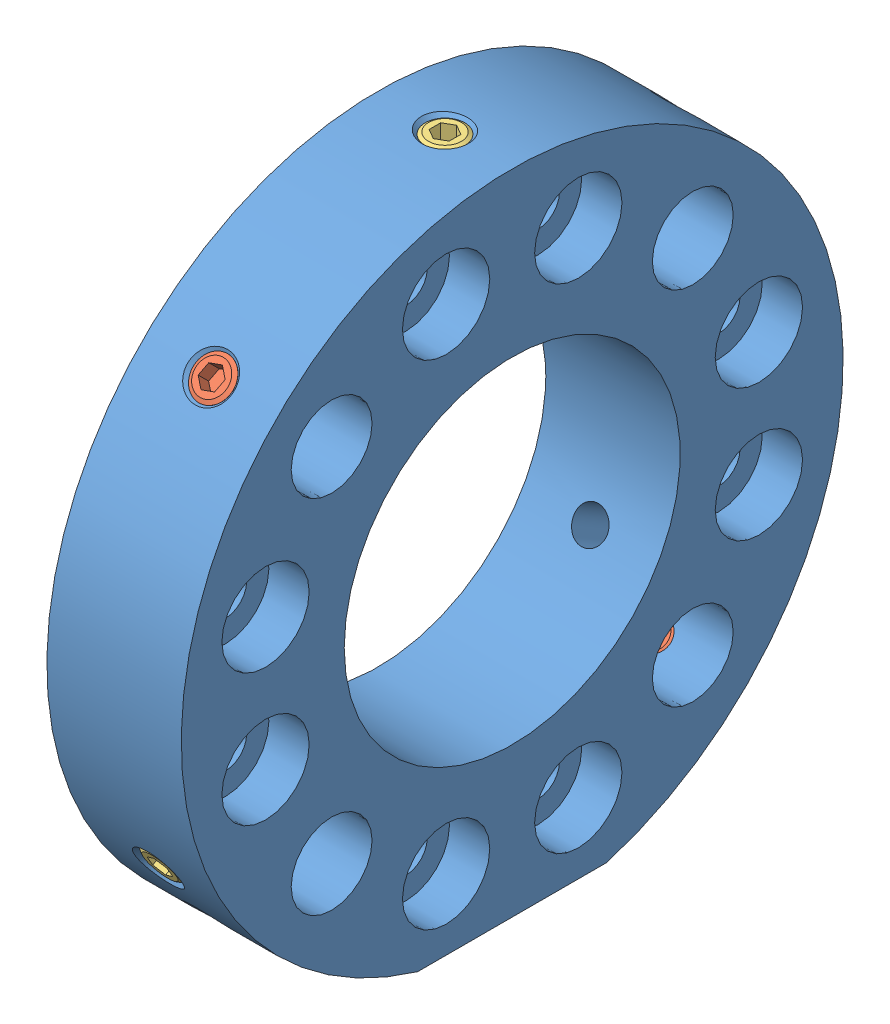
SolidWorks assembly 85632.SLDASM, configuration Default (file format 4700). Lengths in mm.
Overall size (10 48.22 49.25).
8 component instances, 3 part files, 2 mates.
Components (placement in the parent):
- 85632 plate-1: 85632 plate.sldprt [Default] at (-24.1532 -1.3149 10.652) size (10 48.23 49.25)
- M3x2.5 set screw included-1: M3x2.5 set screw included.SLDPRT [B18.3.6M - M3 x 0.5 x 2.5 Hex Socket Flat Pt. SS --N] at (-19.1532 16.045 28.012) x (0 -0.707107 -0.707107) z (0.73062 -0.482801 0.482801) size (2.5 3 3)
- M3x2.5 set screw included-8: M3x2.5 set screw included.SLDPRT [B18.3.6M - M3 x 0.5 x 2.5 Hex Socket Flat Pt. SS --N] at (-19.1532 16.045 -6.7079) x (0 -0.707107 0.707107) z (0.73062 0.482801 0.482801) size (2.5 3 3)
- M3x2.5 set screw included-9: M3x2.5 set screw included.SLDPRT [B18.3.6M - M3 x 0.5 x 2.5 Hex Socket Flat Pt. SS --N] at (-19.1532 -18.6749 -6.7079) x (0 0.707107 0.707107) z (0.73062 0.482801 -0.482801) size (2.5 3 3)
- M3x2.5 set screw included-10: M3x2.5 set screw included.SLDPRT [B18.3.6M - M3 x 0.5 x 2.5 Hex Socket Flat Pt. SS --N] at (-19.1532 -18.6749 28.012) x (0 0.707107 -0.707107) z (0.73062 -0.482801 -0.482801) size (2.5 3 3)
- M3x6 set screw included-11: M3x6 set screw included.SLDPRT [B18.3.6M - M3 x 0.5 x 6 Hex Socket Flat Pt. SS --N] at (-19.1532 23.1779 10.652) x (0 -1 0) z (0 0 1) size (6 3 3)
- M3x6 set screw included-12: M3x6 set screw included.SLDPRT [B18.3.6M - M3 x 0.5 x 6 Hex Socket Flat Pt. SS --N] at (-19.1532 -13.5613 -10.5594) x (0 0.5 0.866025) z (0 0.866025 -0.5) size (6 3 3)
- M3x6 set screw included-13: M3x6 set screw included.SLDPRT [B18.3.6M - M3 x 0.5 x 6 Hex Socket Flat Pt. SS --N] at (-19.1532 -13.5613 31.8634) x (0 0.5 -0.866025) z (0 -0.866025 -0.5) size (6 3 3)
Mates (geometry in assembly coordinates):
- Concentric11: concentric aligned: cylinder of 85632 plate-1 through (-19.1532 16.0976 28.0645) axis (0 0.707107 0.707107) radius 1.25; cylinder of M3x2.5 set screw included-1 through (-19.1532 25.0253 36.9922) axis (0 0.707107 0.707107) radius 1.5
- Concentric2: concentric aligned: cylinder of 85632 plate-1 through (-19.1532 23.3101 10.652) axis (0 1 0) radius 1.25; cylinder of M3x6 set screw included-11 through (-19.1532 35.8779 10.652) axis (0 1 0) radius 1.5
